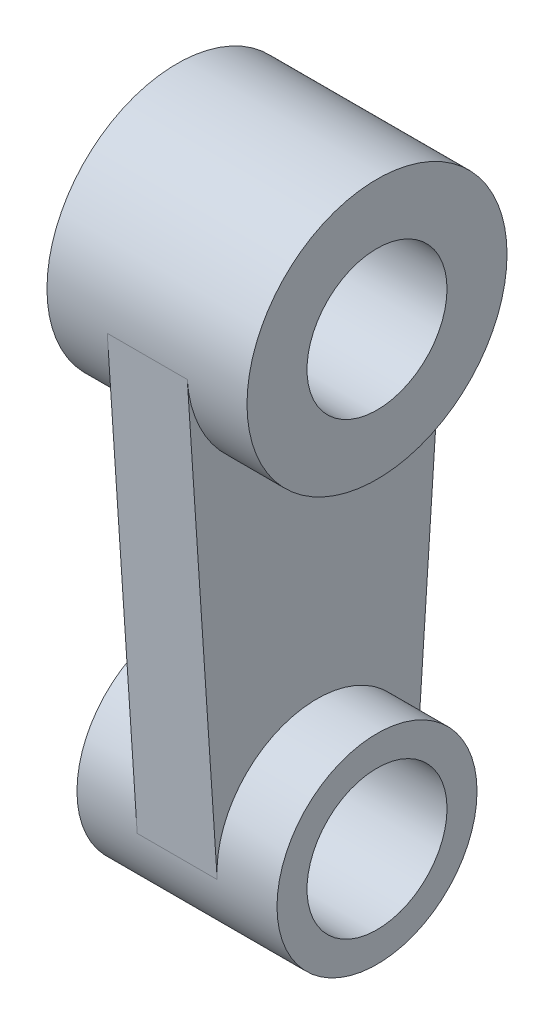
ISO-10303-21;
HEADER;
FILE_DESCRIPTION(('STEP AP214'),'2;1');
FILE_NAME('part.step','',(''),(''),'','','');
FILE_SCHEMA(('AUTOMOTIVE_DESIGN { 1 0 10303 214 1 1 1 1 }'));
ENDSEC;
DATA;
#1=APPLICATION_CONTEXT('core data for automotive mechanical design processes');
#2=APPLICATION_PROTOCOL_DEFINITION('international standard','automotive_design',2000,#1);
#3=PRODUCT_CONTEXT('',#1,'mechanical');
#4=PRODUCT('Part','Part','',(#3));
#5=PRODUCT_RELATED_PRODUCT_CATEGORY('part','',(#4));
#6=PRODUCT_DEFINITION_FORMATION('','',#4);
#7=PRODUCT_DEFINITION_CONTEXT('part definition',#1,'design');
#8=PRODUCT_DEFINITION('design','',#6,#7);
#9=PRODUCT_DEFINITION_SHAPE('','',#8);
#10=(LENGTH_UNIT() NAMED_UNIT(*) SI_UNIT(.MILLI.,.METRE.));
#11=(NAMED_UNIT(*) PLANE_ANGLE_UNIT() SI_UNIT($,.RADIAN.));
#12=(NAMED_UNIT(*) SI_UNIT($,.STERADIAN.) SOLID_ANGLE_UNIT());
#13=UNCERTAINTY_MEASURE_WITH_UNIT(LENGTH_MEASURE(1.E-05),#10,'distance_accuracy_value','');
#14=(GEOMETRIC_REPRESENTATION_CONTEXT(3) GLOBAL_UNCERTAINTY_ASSIGNED_CONTEXT((#13)) GLOBAL_UNIT_ASSIGNED_CONTEXT((#10,
#11,#12)) REPRESENTATION_CONTEXT('',''));
#15=CARTESIAN_POINT('',(0.,0.,0.));
#16=DIRECTION('',(0.,0.,1.));
#17=DIRECTION('',(1.,0.,0.));
#18=AXIS2_PLACEMENT_3D('',#15,#16,#17);
#19=CARTESIAN_POINT('',(10.,-2.16666666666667,32.4276973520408));
#20=DIRECTION('',(0.,0.0666666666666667,-0.997775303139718));
#21=DIRECTION('',(0.,0.997775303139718,0.0666666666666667));
#22=AXIS2_PLACEMENT_3D('',#19,#20,#21);
#23=PLANE('',#22);
#24=DIRECTION('',(0.,-0.997775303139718,-0.0666666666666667));
#25=VECTOR('',#24,1.);
#26=CARTESIAN_POINT('',(-10.,-2.16666666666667,32.4276973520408));
#27=LINE('',#26,#25);
#28=CARTESIAN_POINT('',(-10.,-2.16666666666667,32.4276973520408));
#29=VERTEX_POINT('',#28);
#30=CARTESIAN_POINT('',(-10.,-114.166666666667,24.9443825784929));
#31=VERTEX_POINT('',#30);
#32=EDGE_CURVE('E84',#29,#31,#27,.T.);
#33=ORIENTED_EDGE('',*,*,#32,.T.);
#34=DIRECTION('',(-1.,0.,0.));
#35=VECTOR('',#34,1.);
#36=CARTESIAN_POINT('',(10.,-114.166666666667,24.9443825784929));
#37=LINE('',#36,#35);
#38=CARTESIAN_POINT('',(10.,-114.166666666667,24.9443825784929));
#39=VERTEX_POINT('',#38);
#40=EDGE_CURVE('E44',#39,#31,#37,.T.);
#41=ORIENTED_EDGE('',*,*,#40,.F.);
#42=DIRECTION('',(0.,-0.997775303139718,-0.0666666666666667));
#43=VECTOR('',#42,1.);
#44=CARTESIAN_POINT('',(10.,-2.16666666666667,32.4276973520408));
#45=LINE('',#44,#43);
#46=CARTESIAN_POINT('',(10.,-2.16666666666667,32.4276973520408));
#47=VERTEX_POINT('',#46);
#48=EDGE_CURVE('E97',#47,#39,#45,.T.);
#49=ORIENTED_EDGE('',*,*,#48,.F.);
#50=DIRECTION('',(-1.,0.,0.));
#51=VECTOR('',#50,1.);
#52=CARTESIAN_POINT('',(10.,-2.16666666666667,32.4276973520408));
#53=LINE('',#52,#51);
#54=EDGE_CURVE('E11',#47,#29,#53,.T.);
#55=ORIENTED_EDGE('',*,*,#54,.T.);
#56=EDGE_LOOP('',(#33,#41,#49,#55));
#57=FACE_BOUND('',#56,.T.);
#58=ADVANCED_FACE('F37',(#57),#23,.F.);
#59=CARTESIAN_POINT('',(10.,-2.16666666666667,-32.4276973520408));
#60=DIRECTION('',(0.,-0.0666666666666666,-0.997775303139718));
#61=DIRECTION('',(0.,0.997775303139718,-0.0666666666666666));
#62=AXIS2_PLACEMENT_3D('',#59,#60,#61);
#63=PLANE('',#62);
#64=DIRECTION('',(0.,-0.997775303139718,0.0666666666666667));
#65=VECTOR('',#64,1.);
#66=CARTESIAN_POINT('',(-10.,-2.16666666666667,-32.4276973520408));
#67=LINE('',#66,#65);
#68=CARTESIAN_POINT('',(-10.,-2.16666666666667,-32.4276973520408));
#69=VERTEX_POINT('',#68);
#70=CARTESIAN_POINT('',(-10.,-114.166666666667,-24.944382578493));
#71=VERTEX_POINT('',#70);
#72=EDGE_CURVE('E83',#69,#71,#67,.T.);
#73=ORIENTED_EDGE('',*,*,#72,.F.);
#74=DIRECTION('',(-1.,0.,0.));
#75=VECTOR('',#74,1.);
#76=CARTESIAN_POINT('',(10.,-2.16666666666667,-32.4276973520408));
#77=LINE('',#76,#75);
#78=CARTESIAN_POINT('',(10.,-2.16666666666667,-32.4276973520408));
#79=VERTEX_POINT('',#78);
#80=EDGE_CURVE('E51',#79,#69,#77,.T.);
#81=ORIENTED_EDGE('',*,*,#80,.F.);
#82=DIRECTION('',(0.,-0.997775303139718,0.0666666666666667));
#83=VECTOR('',#82,1.);
#84=CARTESIAN_POINT('',(10.,-2.16666666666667,-32.4276973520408));
#85=LINE('',#84,#83);
#86=CARTESIAN_POINT('',(10.,-114.166666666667,-24.9443825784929));
#87=VERTEX_POINT('',#86);
#88=EDGE_CURVE('E91',#79,#87,#85,.T.);
#89=ORIENTED_EDGE('',*,*,#88,.T.);
#90=DIRECTION('',(-1.,0.,0.));
#91=VECTOR('',#90,1.);
#92=CARTESIAN_POINT('',(10.,-114.166666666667,-24.944382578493));
#93=LINE('',#92,#91);
#94=EDGE_CURVE('E78',#87,#71,#93,.T.);
#95=ORIENTED_EDGE('',*,*,#94,.T.);
#96=EDGE_LOOP('',(#73,#81,#89,#95));
#97=FACE_BOUND('',#96,.T.);
#98=ADVANCED_FACE('F89',(#97),#63,.T.);
#99=CARTESIAN_POINT('',(10.,0.,0.));
#100=DIRECTION('',(1.,0.,0.));
#101=DIRECTION('',(0.,0.,-1.));
#102=AXIS2_PLACEMENT_3D('',#99,#100,#101);
#103=PLANE('',#102);
#104=CARTESIAN_POINT('',(10.,0.,0.));
#105=DIRECTION('',(1.,0.,0.));
#106=DIRECTION('',(0.,0.,-1.));
#107=AXIS2_PLACEMENT_3D('',#104,#105,#106);
#108=CIRCLE('',#107,32.5);
#109=EDGE_CURVE('E95',#47,#79,#108,.T.);
#110=ORIENTED_EDGE('',*,*,#109,.F.);
#111=ORIENTED_EDGE('',*,*,#48,.T.);
#112=CARTESIAN_POINT('',(10.,-112.5,0.));
#113=DIRECTION('',(1.,0.,0.));
#114=DIRECTION('',(0.,0.,-1.));
#115=AXIS2_PLACEMENT_3D('',#112,#113,#114);
#116=CIRCLE('',#115,25.);
#117=EDGE_CURVE('E101',#87,#39,#116,.T.);
#118=ORIENTED_EDGE('',*,*,#117,.F.);
#119=ORIENTED_EDGE('',*,*,#88,.F.);
#120=EDGE_LOOP('',(#110,#111,#118,#119));
#121=FACE_BOUND('',#120,.T.);
#122=ADVANCED_FACE('F114',(#121),#103,.T.);
#123=CARTESIAN_POINT('',(-10.,0.,0.));
#124=DIRECTION('',(1.,0.,0.));
#125=DIRECTION('',(0.,0.,-1.));
#126=AXIS2_PLACEMENT_3D('',#123,#124,#125);
#127=PLANE('',#126);
#128=CARTESIAN_POINT('',(-10.,0.,0.));
#129=DIRECTION('',(1.,0.,0.));
#130=DIRECTION('',(0.,0.,-1.));
#131=AXIS2_PLACEMENT_3D('',#128,#129,#130);
#132=CIRCLE('',#131,32.5);
#133=EDGE_CURVE('E94',#29,#69,#132,.T.);
#134=ORIENTED_EDGE('',*,*,#133,.T.);
#135=ORIENTED_EDGE('',*,*,#72,.T.);
#136=CARTESIAN_POINT('',(-10.,-112.5,0.));
#137=DIRECTION('',(1.,0.,0.));
#138=DIRECTION('',(0.,0.,-1.));
#139=AXIS2_PLACEMENT_3D('',#136,#137,#138);
#140=CIRCLE('',#139,25.);
#141=EDGE_CURVE('E74',#71,#31,#140,.T.);
#142=ORIENTED_EDGE('',*,*,#141,.T.);
#143=ORIENTED_EDGE('',*,*,#32,.F.);
#144=EDGE_LOOP('',(#134,#135,#142,#143));
#145=FACE_BOUND('',#144,.T.);
#146=ADVANCED_FACE('F93',(#145),#127,.F.);
#147=CARTESIAN_POINT('',(25.,0.,0.));
#148=DIRECTION('',(-1.,0.,0.));
#149=DIRECTION('',(0.,0.,1.));
#150=AXIS2_PLACEMENT_3D('',#147,#148,#149);
#151=CYLINDRICAL_SURFACE('',#150,17.5);
#152=CARTESIAN_POINT('',(25.,0.,0.));
#153=DIRECTION('',(1.,0.,0.));
#154=DIRECTION('',(0.,0.,-1.));
#155=AXIS2_PLACEMENT_3D('',#152,#153,#154);
#156=CIRCLE('',#155,17.5);
#157=CARTESIAN_POINT('',(25.,0.,-17.5));
#158=VERTEX_POINT('',#157);
#159=EDGE_CURVE('E119',#158,#158,#156,.T.);
#160=ORIENTED_EDGE('',*,*,#159,.T.);
#161=EDGE_LOOP('',(#160));
#162=FACE_BOUND('',#161,.T.);
#163=CARTESIAN_POINT('',(-25.,0.,0.));
#164=DIRECTION('',(1.,0.,0.));
#165=DIRECTION('',(0.,0.,-1.));
#166=AXIS2_PLACEMENT_3D('',#163,#164,#165);
#167=CIRCLE('',#166,17.5);
#168=CARTESIAN_POINT('',(-25.,0.,-17.5));
#169=VERTEX_POINT('',#168);
#170=EDGE_CURVE('E120',#169,#169,#167,.T.);
#171=ORIENTED_EDGE('',*,*,#170,.F.);
#172=EDGE_LOOP('',(#171));
#173=FACE_BOUND('',#172,.T.);
#174=ADVANCED_FACE('F172',(#162,#173),#151,.F.);
#175=CARTESIAN_POINT('',(25.,0.,0.));
#176=DIRECTION('',(-1.,0.,0.));
#177=DIRECTION('',(0.,0.,1.));
#178=AXIS2_PLACEMENT_3D('',#175,#176,#177);
#179=CYLINDRICAL_SURFACE('',#178,32.5);
#180=ORIENTED_EDGE('',*,*,#109,.T.);
#181=ORIENTED_EDGE('',*,*,#80,.T.);
#182=ORIENTED_EDGE('',*,*,#133,.F.);
#183=ORIENTED_EDGE('',*,*,#54,.F.);
#184=EDGE_LOOP('',(#180,#181,#182,#183));
#185=FACE_BOUND('',#184,.T.);
#186=CARTESIAN_POINT('',(25.,0.,0.));
#187=DIRECTION('',(1.,0.,0.));
#188=DIRECTION('',(0.,0.,-1.));
#189=AXIS2_PLACEMENT_3D('',#186,#187,#188);
#190=CIRCLE('',#189,32.5);
#191=CARTESIAN_POINT('',(25.,0.,-32.5));
#192=VERTEX_POINT('',#191);
#193=EDGE_CURVE('E106',#192,#192,#190,.T.);
#194=ORIENTED_EDGE('',*,*,#193,.F.);
#195=EDGE_LOOP('',(#194));
#196=FACE_BOUND('',#195,.T.);
#197=CARTESIAN_POINT('',(-25.,0.,0.));
#198=DIRECTION('',(1.,0.,0.));
#199=DIRECTION('',(0.,0.,-1.));
#200=AXIS2_PLACEMENT_3D('',#197,#198,#199);
#201=CIRCLE('',#200,32.5);
#202=CARTESIAN_POINT('',(-25.,0.,-32.5));
#203=VERTEX_POINT('',#202);
#204=EDGE_CURVE('E116',#203,#203,#201,.T.);
#205=ORIENTED_EDGE('',*,*,#204,.T.);
#206=EDGE_LOOP('',(#205));
#207=FACE_BOUND('',#206,.T.);
#208=ADVANCED_FACE('F111',(#185,#196,#207),#179,.T.);
#209=CARTESIAN_POINT('',(25.,0.,0.));
#210=DIRECTION('',(1.,0.,0.));
#211=DIRECTION('',(0.,0.,-1.));
#212=AXIS2_PLACEMENT_3D('',#209,#210,#211);
#213=PLANE('',#212);
#214=ORIENTED_EDGE('',*,*,#159,.F.);
#215=EDGE_LOOP('',(#214));
#216=FACE_BOUND('',#215,.T.);
#217=ORIENTED_EDGE('',*,*,#193,.T.);
#218=EDGE_LOOP('',(#217));
#219=FACE_BOUND('',#218,.T.);
#220=ADVANCED_FACE('F179',(#216,#219),#213,.T.);
#221=CARTESIAN_POINT('',(-25.,0.,0.));
#222=DIRECTION('',(1.,0.,0.));
#223=DIRECTION('',(0.,0.,-1.));
#224=AXIS2_PLACEMENT_3D('',#221,#222,#223);
#225=PLANE('',#224);
#226=ORIENTED_EDGE('',*,*,#170,.T.);
#227=EDGE_LOOP('',(#226));
#228=FACE_BOUND('',#227,.T.);
#229=ORIENTED_EDGE('',*,*,#204,.F.);
#230=EDGE_LOOP('',(#229));
#231=FACE_BOUND('',#230,.T.);
#232=ADVANCED_FACE('F145',(#228,#231),#225,.F.);
#233=CARTESIAN_POINT('',(25.,-112.5,0.));
#234=DIRECTION('',(-1.,0.,0.));
#235=DIRECTION('',(0.,0.,1.));
#236=AXIS2_PLACEMENT_3D('',#233,#234,#235);
#237=CYLINDRICAL_SURFACE('',#236,25.);
#238=ORIENTED_EDGE('',*,*,#117,.T.);
#239=ORIENTED_EDGE('',*,*,#40,.T.);
#240=ORIENTED_EDGE('',*,*,#141,.F.);
#241=ORIENTED_EDGE('',*,*,#94,.F.);
#242=EDGE_LOOP('',(#238,#239,#240,#241));
#243=FACE_BOUND('',#242,.T.);
#244=CARTESIAN_POINT('',(25.,-112.5,0.));
#245=DIRECTION('',(1.,0.,0.));
#246=DIRECTION('',(0.,0.,-1.));
#247=AXIS2_PLACEMENT_3D('',#244,#245,#246);
#248=CIRCLE('',#247,25.);
#249=CARTESIAN_POINT('',(25.,-112.5,-25.));
#250=VERTEX_POINT('',#249);
#251=EDGE_CURVE('E131',#250,#250,#248,.T.);
#252=ORIENTED_EDGE('',*,*,#251,.F.);
#253=EDGE_LOOP('',(#252));
#254=FACE_BOUND('',#253,.T.);
#255=CARTESIAN_POINT('',(-25.,-112.5,0.));
#256=DIRECTION('',(1.,0.,0.));
#257=DIRECTION('',(0.,0.,-1.));
#258=AXIS2_PLACEMENT_3D('',#255,#256,#257);
#259=CIRCLE('',#258,25.);
#260=CARTESIAN_POINT('',(-25.,-112.5,-25.));
#261=VERTEX_POINT('',#260);
#262=EDGE_CURVE('E132',#261,#261,#259,.T.);
#263=ORIENTED_EDGE('',*,*,#262,.T.);
#264=EDGE_LOOP('',(#263));
#265=FACE_BOUND('',#264,.T.);
#266=ADVANCED_FACE('F76',(#243,#254,#265),#237,.T.);
#267=CARTESIAN_POINT('',(25.,-112.5,0.));
#268=DIRECTION('',(-1.,0.,0.));
#269=DIRECTION('',(0.,0.,1.));
#270=AXIS2_PLACEMENT_3D('',#267,#268,#269);
#271=CYLINDRICAL_SURFACE('',#270,17.5);
#272=CARTESIAN_POINT('',(25.,-112.5,0.));
#273=DIRECTION('',(1.,0.,0.));
#274=DIRECTION('',(0.,0.,-1.));
#275=AXIS2_PLACEMENT_3D('',#272,#273,#274);
#276=CIRCLE('',#275,17.5);
#277=CARTESIAN_POINT('',(25.,-112.5,-17.5));
#278=VERTEX_POINT('',#277);
#279=EDGE_CURVE('E123',#278,#278,#276,.T.);
#280=ORIENTED_EDGE('',*,*,#279,.T.);
#281=EDGE_LOOP('',(#280));
#282=FACE_BOUND('',#281,.T.);
#283=CARTESIAN_POINT('',(-25.,-112.5,0.));
#284=DIRECTION('',(1.,0.,0.));
#285=DIRECTION('',(0.,0.,-1.));
#286=AXIS2_PLACEMENT_3D('',#283,#284,#285);
#287=CIRCLE('',#286,17.5);
#288=CARTESIAN_POINT('',(-25.,-112.5,-17.5));
#289=VERTEX_POINT('',#288);
#290=EDGE_CURVE('E128',#289,#289,#287,.T.);
#291=ORIENTED_EDGE('',*,*,#290,.F.);
#292=EDGE_LOOP('',(#291));
#293=FACE_BOUND('',#292,.T.);
#294=ADVANCED_FACE('F144',(#282,#293),#271,.F.);
#295=CARTESIAN_POINT('',(25.,0.,0.));
#296=DIRECTION('',(1.,0.,0.));
#297=DIRECTION('',(0.,0.,-1.));
#298=AXIS2_PLACEMENT_3D('',#295,#296,#297);
#299=PLANE('',#298);
#300=ORIENTED_EDGE('',*,*,#251,.T.);
#301=EDGE_LOOP('',(#300));
#302=FACE_BOUND('',#301,.T.);
#303=ORIENTED_EDGE('',*,*,#279,.F.);
#304=EDGE_LOOP('',(#303));
#305=FACE_BOUND('',#304,.T.);
#306=ADVANCED_FACE('F140',(#302,#305),#299,.T.);
#307=CARTESIAN_POINT('',(-25.,0.,0.));
#308=DIRECTION('',(1.,0.,0.));
#309=DIRECTION('',(0.,0.,-1.));
#310=AXIS2_PLACEMENT_3D('',#307,#308,#309);
#311=PLANE('',#310);
#312=ORIENTED_EDGE('',*,*,#262,.F.);
#313=EDGE_LOOP('',(#312));
#314=FACE_BOUND('',#313,.T.);
#315=ORIENTED_EDGE('',*,*,#290,.T.);
#316=EDGE_LOOP('',(#315));
#317=FACE_BOUND('',#316,.T.);
#318=ADVANCED_FACE('F149',(#314,#317),#311,.F.);
#319=CLOSED_SHELL('',(#58,#98,#122,#146,#174,#208,#220,#232,#266,#294,#306,#318));
#320=MANIFOLD_SOLID_BREP('B2',#319);
#321=ADVANCED_BREP_SHAPE_REPRESENTATION('',(#18,#320),#14);
#322=SHAPE_DEFINITION_REPRESENTATION(#9,#321);
ENDSEC;
END-ISO-10303-21;
